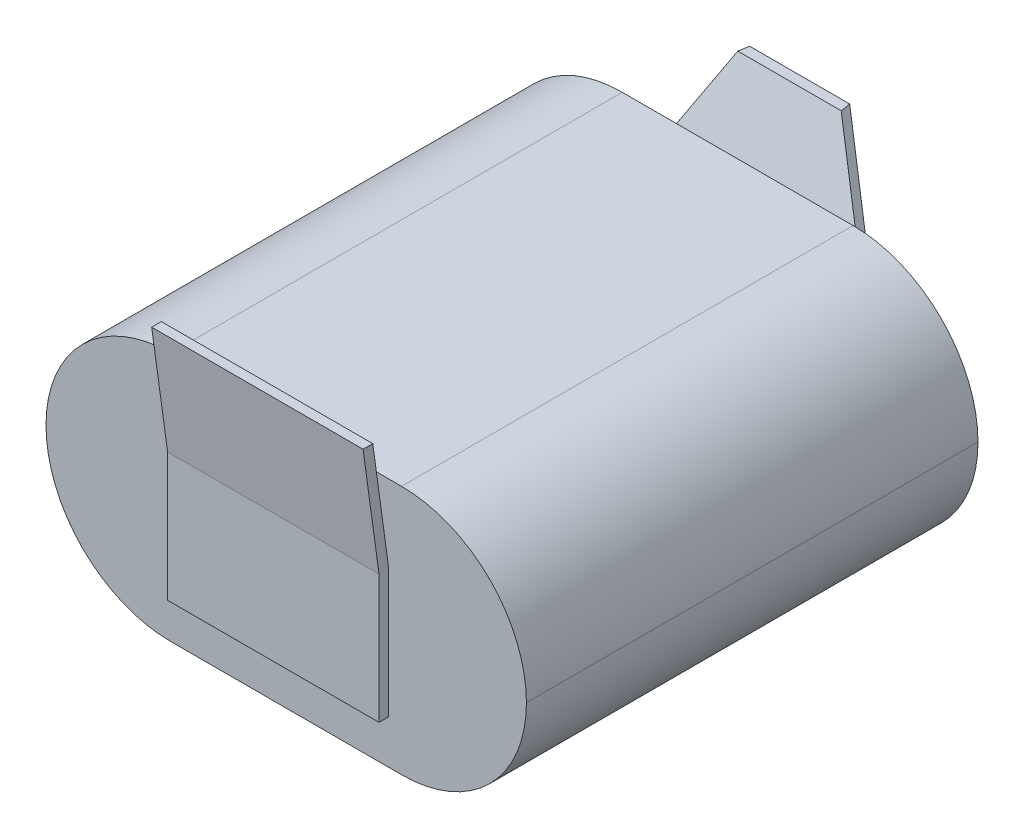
from build123d import *

# Parameters (mm, degrees)
EXTRUSION1_DEPTH        = 23.5
EXTRUSION2_DEPTH        = 5.5
EXTRUSION3_DEPTH        = 5.5
ENL_V_MAT_EXTRU_1_DEPTH = 0.5


with BuildPart() as part:
    # Esquisse1 → Extrusion1 (new body)
    with BuildSketch(Plane.XY):
        with BuildLine():
            Line((-8.839098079, -7.6), (3.170901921, -7.6))
            ThreePointArc((3.170901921, -7.6), (7.767095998, -9.503805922), (9.670901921, -14.1))
            Line((9.670901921, -14.1), (9.670901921, -14.11))
            ThreePointArc((9.670901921, -14.11), (7.770024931, -18.69912301), (3.180901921, -20.6))
            Line((3.180901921, -20.6), (-8.829098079, -20.6))
            ThreePointArc((-8.829098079, -20.6), (-13.425292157, -18.696194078), (-15.329098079, -14.1))
            Line((-15.329098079, -14.1), (-15.329098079, -14.09))
            ThreePointArc((-15.329098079, -14.09), (-13.428221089, -9.50087699), (-8.839098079, -7.6))
        make_face()
    extrude(amount=-EXTRUSION1_DEPTH)

    # Esquisse2 → Extrusion2 (add, symmetric)
    with BuildSketch(Plane(origin=(-3, 0, 0), x_dir=(0, 0, -1), z_dir=(1, 0, 0))):
        Polygon((0, -18.324724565), (0, -11.607872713), (-0.824207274, -5.6), (-1.328890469, -5.6), (-0.5, -11.64200981), (-0.5, -18.324724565), align=None)
    extrude(amount=EXTRUSION2_DEPTH, both=True)

    # Esquisse3 → Extrusion3 (add, symmetric)
    with BuildSketch(Plane(origin=(-3, 0, 0), x_dir=(0, 0, -1), z_dir=(1, 0, 0))):
        Polygon((23.5, -18.324724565), (24, -18.324724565), (24, -14.11), (26.890994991, -5.6), (26.362930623, -5.6), (23.5, -14.027389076), align=None)
    extrude(amount=EXTRUSION3_DEPTH, both=True)

    # Esquisse4 → Enl_v. mat.-Extru.1 (cut)
    with BuildSketch(Plane(origin=(0, -8.769547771, -25.814244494), x_dir=(-1, 0, 0), z_dir=(0, -0.32166286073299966, -0.9468542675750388))):
        Polygon((0.645397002, 3.83477814), (-2.5, -2.321461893), (-3.257578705, -2.321461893), (-3.257578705, 4.719989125), (9.257578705, 4.719989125), (9.257578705, -2.321461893), (8.5, -2.321461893), (5.354602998, 3.83477814), align=None)
    extrude(amount=-ENL_V_MAT_EXTRU_1_DEPTH, mode=Mode.SUBTRACT)


solid = part.part
